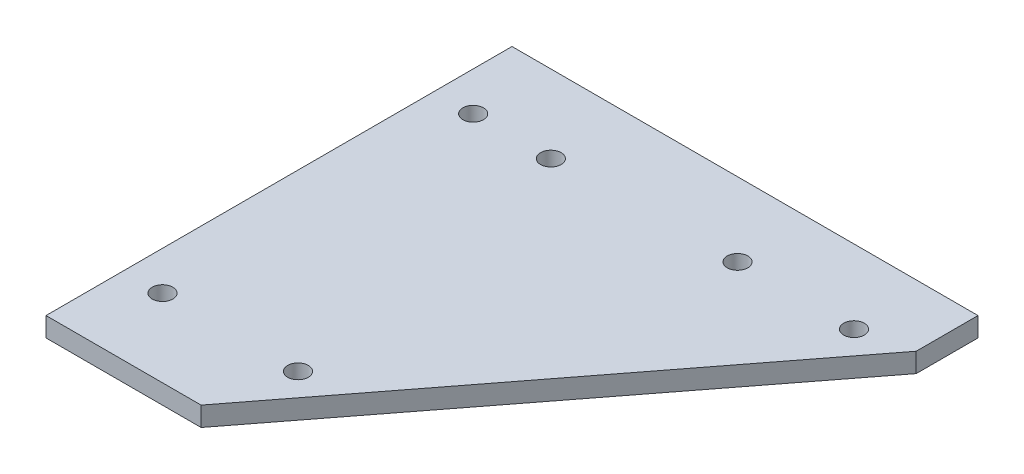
from build123d import *

# Parameters (mm, degrees)
SKETCH1_W          = 152.4
SKETCH1_H          = 152.4
EXTRUDE1_DEPTH     = 6.35
EXTRUDE2_DEPTH     = 216.619670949
SKETCH3_R          = 3.37312
CUT_EXTRUDE1_DEPTH = 216.619670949


with BuildPart() as part:
    # Sketch1 → Extrude1 (new body)
    with BuildSketch(Plane(origin=(0, 0, 0), x_dir=(1, 0, 0), z_dir=(0, 1, 0))):
        with Locations((76.2, 76.2)):
            Rectangle(SKETCH1_W, SKETCH1_H)
    extrude(amount=EXTRUDE1_DEPTH)

    # Sketch2 → Extrude2 (cut, through all)
    with BuildSketch(Plane.XZ):
        Polygon((50.728278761, 0), (152.4, -132.189094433), (152.4, 0), align=None)
    extrude(amount=-EXTRUDE2_DEPTH, mode=Mode.SUBTRACT)

    # Sketch3 → Cut-Extrude1 (cut, through all)
    with BuildSketch(Plane.XZ):
        with Locations(Location((57.006555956, -25.3999988, 0), (0, 0, 270))):
            Circle(SKETCH3_R)
        with Locations(Location((12.7, -25.4, 0), (0, 0, 270))):
            Circle(SKETCH3_R)
        with Locations(Location((135.984785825, -128.273876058, 0), (0, 0, 270))):
            Circle(SKETCH3_R)
        with Locations(Location((97.884785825, -128.273876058, 0), (0, 0, 270))):
            Circle(SKETCH3_R)
        with Locations(Location((38.1, -127, 0), (0, 0, 270))):
            Circle(SKETCH3_R)
        with Locations(Location((12.7, -127, 0), (0, 0, 270))):
            Circle(SKETCH3_R)
    extrude(amount=-CUT_EXTRUDE1_DEPTH, mode=Mode.SUBTRACT)


solid = part.part
